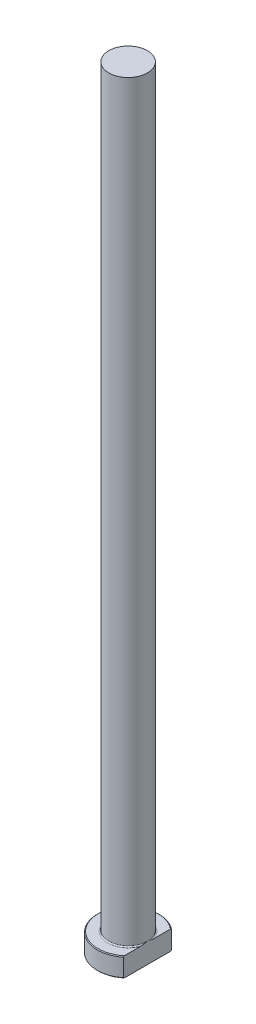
ISO-10303-21;
HEADER;
FILE_DESCRIPTION(('STEP AP214'),'2;1');
FILE_NAME('part.step','',(''),(''),'','','');
FILE_SCHEMA(('AUTOMOTIVE_DESIGN { 1 0 10303 214 1 1 1 1 }'));
ENDSEC;
DATA;
#1=APPLICATION_CONTEXT('core data for automotive mechanical design processes');
#2=APPLICATION_PROTOCOL_DEFINITION('international standard','automotive_design',2000,#1);
#3=PRODUCT_CONTEXT('',#1,'mechanical');
#4=PRODUCT('Part','Part','',(#3));
#5=PRODUCT_RELATED_PRODUCT_CATEGORY('part','',(#4));
#6=PRODUCT_DEFINITION_FORMATION('','',#4);
#7=PRODUCT_DEFINITION_CONTEXT('part definition',#1,'design');
#8=PRODUCT_DEFINITION('design','',#6,#7);
#9=PRODUCT_DEFINITION_SHAPE('','',#8);
#10=(LENGTH_UNIT() NAMED_UNIT(*) SI_UNIT(.MILLI.,.METRE.));
#11=(NAMED_UNIT(*) PLANE_ANGLE_UNIT() SI_UNIT($,.RADIAN.));
#12=(NAMED_UNIT(*) SI_UNIT($,.STERADIAN.) SOLID_ANGLE_UNIT());
#13=UNCERTAINTY_MEASURE_WITH_UNIT(LENGTH_MEASURE(1.E-05),#10,'distance_accuracy_value','');
#14=(GEOMETRIC_REPRESENTATION_CONTEXT(3) GLOBAL_UNCERTAINTY_ASSIGNED_CONTEXT((#13)) GLOBAL_UNIT_ASSIGNED_CONTEXT((#10,
#11,#12)) REPRESENTATION_CONTEXT('',''));
#15=CARTESIAN_POINT('',(0.,0.,0.));
#16=DIRECTION('',(0.,0.,1.));
#17=DIRECTION('',(1.,0.,0.));
#18=AXIS2_PLACEMENT_3D('',#15,#16,#17);
#19=CARTESIAN_POINT('',(0.,0.,0.));
#20=DIRECTION('',(0.,-1.,0.));
#21=DIRECTION('',(0.,0.,-1.));
#22=AXIS2_PLACEMENT_3D('',#19,#20,#21);
#23=PLANE('',#22);
#24=CARTESIAN_POINT('',(0.,0.,0.));
#25=DIRECTION('',(0.,-1.,0.));
#26=DIRECTION('',(0.,0.,-1.));
#27=AXIS2_PLACEMENT_3D('',#24,#25,#26);
#28=CIRCLE('',#27,7.79999999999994);
#29=CARTESIAN_POINT('',(4.99999999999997,0.,5.98665181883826));
#30=VERTEX_POINT('',#29);
#31=CARTESIAN_POINT('',(4.99999999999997,0.,-5.98665181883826));
#32=VERTEX_POINT('',#31);
#33=EDGE_CURVE('E98',#30,#32,#28,.T.);
#34=ORIENTED_EDGE('',*,*,#33,.T.);
#35=DIRECTION('',(0.,0.,1.));
#36=VECTOR('',#35,1.);
#37=CARTESIAN_POINT('',(4.99999999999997,0.,-6.24499799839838));
#38=LINE('',#37,#36);
#39=EDGE_CURVE('E83',#32,#30,#38,.T.);
#40=ORIENTED_EDGE('',*,*,#39,.T.);
#41=EDGE_LOOP('',(#34,#40));
#42=FACE_BOUND('',#41,.T.);
#43=ADVANCED_FACE('F32',(#42),#23,.T.);
#44=CARTESIAN_POINT('',(0.,259.958771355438,0.));
#45=DIRECTION('',(0.,1.,0.));
#46=DIRECTION('',(0.,0.,1.));
#47=AXIS2_PLACEMENT_3D('',#44,#45,#46);
#48=CYLINDRICAL_SURFACE('',#47,7.99999999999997);
#49=CARTESIAN_POINT('',(0.,4.80000000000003,0.));
#50=DIRECTION('',(0.,1.,0.));
#51=DIRECTION('',(0.,0.,1.));
#52=AXIS2_PLACEMENT_3D('',#49,#50,#51);
#53=CIRCLE('',#52,7.99999999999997);
#54=CARTESIAN_POINT('',(4.99999999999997,4.80000000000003,6.24499799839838));
#55=VERTEX_POINT('',#54);
#56=CARTESIAN_POINT('',(4.99999999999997,4.80000000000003,-6.24499799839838));
#57=VERTEX_POINT('',#56);
#58=EDGE_CURVE('E104',#55,#57,#53,.F.);
#59=ORIENTED_EDGE('',*,*,#58,.T.);
#60=DIRECTION('',(0.,-1.,0.));
#61=VECTOR('',#60,1.);
#62=CARTESIAN_POINT('',(4.99999999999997,200.,-6.24499799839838));
#63=LINE('',#62,#61);
#64=CARTESIAN_POINT('',(4.99999999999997,0.200000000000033,-6.24499799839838));
#65=VERTEX_POINT('',#64);
#66=EDGE_CURVE('E183',#57,#65,#63,.T.);
#67=ORIENTED_EDGE('',*,*,#66,.T.);
#68=CARTESIAN_POINT('',(0.,0.200000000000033,0.));
#69=DIRECTION('',(0.,-1.,0.));
#70=DIRECTION('',(0.,0.,-1.));
#71=AXIS2_PLACEMENT_3D('',#68,#69,#70);
#72=CIRCLE('',#71,7.99999999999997);
#73=CARTESIAN_POINT('',(4.99999999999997,0.200000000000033,6.24499799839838));
#74=VERTEX_POINT('',#73);
#75=EDGE_CURVE('E100',#65,#74,#72,.F.);
#76=ORIENTED_EDGE('',*,*,#75,.T.);
#77=DIRECTION('',(0.,-1.,0.));
#78=VECTOR('',#77,1.);
#79=CARTESIAN_POINT('',(4.99999999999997,200.,6.24499799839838));
#80=LINE('',#79,#78);
#81=EDGE_CURVE('E93',#55,#74,#80,.T.);
#82=ORIENTED_EDGE('',*,*,#81,.F.);
#83=EDGE_LOOP('',(#59,#67,#76,#82));
#84=FACE_BOUND('',#83,.T.);
#85=ADVANCED_FACE('F158',(#84),#48,.T.);
#86=CARTESIAN_POINT('',(-7.99999999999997,5.,0.));
#87=DIRECTION('',(0.,1.,0.));
#88=DIRECTION('',(0.,0.,1.));
#89=AXIS2_PLACEMENT_3D('',#86,#87,#88);
#90=PLANE('',#89);
#91=CARTESIAN_POINT('',(0.,5.,0.));
#92=DIRECTION('',(0.,1.,0.));
#93=DIRECTION('',(0.,0.,1.));
#94=AXIS2_PLACEMENT_3D('',#91,#92,#93);
#95=CIRCLE('',#94,7.79999999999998);
#96=CARTESIAN_POINT('',(4.99999999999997,5.,-5.9866518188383));
#97=VERTEX_POINT('',#96);
#98=CARTESIAN_POINT('',(4.99999999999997,5.,5.9866518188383));
#99=VERTEX_POINT('',#98);
#100=EDGE_CURVE('E178',#97,#99,#95,.T.);
#101=ORIENTED_EDGE('',*,*,#100,.T.);
#102=DIRECTION('',(0.,0.,-1.));
#103=VECTOR('',#102,1.);
#104=CARTESIAN_POINT('',(4.99999999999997,5.,0.));
#105=LINE('',#104,#103);
#106=CARTESIAN_POINT('',(4.99999999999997,4.99999999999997,1.75783958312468));
#107=VERTEX_POINT('',#106);
#108=EDGE_CURVE('E57',#99,#107,#105,.T.);
#109=ORIENTED_EDGE('',*,*,#108,.T.);
#110=CARTESIAN_POINT('',(0.,5.,0.));
#111=DIRECTION('',(0.,1.,0.));
#112=DIRECTION('',(0.,0.,1.));
#113=AXIS2_PLACEMENT_3D('',#110,#111,#112);
#114=CIRCLE('',#113,5.29999999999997);
#115=CARTESIAN_POINT('',(4.99999999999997,4.99999999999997,-1.75783958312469));
#116=VERTEX_POINT('',#115);
#117=EDGE_CURVE('E107',#107,#116,#114,.F.);
#118=ORIENTED_EDGE('',*,*,#117,.T.);
#119=EDGE_CURVE('E136',#116,#97,#105,.T.);
#120=ORIENTED_EDGE('',*,*,#119,.T.);
#121=EDGE_LOOP('',(#101,#109,#118,#120));
#122=FACE_BOUND('',#121,.T.);
#123=ADVANCED_FACE('F147',(#122),#90,.T.);
#124=CARTESIAN_POINT('',(0.,5.,0.));
#125=DIRECTION('',(0.,-1.,0.));
#126=DIRECTION('',(0.,0.,-1.));
#127=AXIS2_PLACEMENT_3D('',#124,#125,#126);
#128=CONICAL_SURFACE('',#127,7.79999999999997,0.785398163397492);
#129=ORIENTED_EDGE('',*,*,#58,.F.);
#130=CARTESIAN_POINT('',(4.99999999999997,-1.82162423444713,13.7401563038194));
#131=CARTESIAN_POINT('',(4.99999999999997,-1.61889813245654,13.5244204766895));
#132=CARTESIAN_POINT('',(4.99999999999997,-1.41646387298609,13.3084101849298));
#133=CARTESIAN_POINT('',(4.99999999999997,-1.01227657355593,12.8757508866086));
#134=CARTESIAN_POINT('',(4.99999999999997,-0.810523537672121,12.65910187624));
#135=CARTESIAN_POINT('',(4.99999999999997,-0.206157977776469,12.0077661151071));
#136=CARTESIAN_POINT('',(4.99999999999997,0.195280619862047,11.571988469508));
#137=CARTESIAN_POINT('',(4.99999999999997,1.00388282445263,10.6856136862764));
#138=CARTESIAN_POINT('',(4.99999999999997,1.41093902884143,10.234918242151));
#139=CARTESIAN_POINT('',(4.99999999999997,2.01658324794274,9.55471676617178));
#140=CARTESIAN_POINT('',(4.99999999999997,2.2175823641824,9.32735800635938));
#141=CARTESIAN_POINT('',(4.99999999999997,2.61761142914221,8.87091599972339));
#142=CARTESIAN_POINT('',(4.99999999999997,2.81664139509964,8.64183276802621));
#143=CARTESIAN_POINT('',(4.99999999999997,3.21217345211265,8.18170099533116));
#144=CARTESIAN_POINT('',(4.99999999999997,3.4086768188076,7.95065355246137));
#145=CARTESIAN_POINT('',(4.99999999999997,3.79865427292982,7.48599989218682));
#146=CARTESIAN_POINT('',(4.99999999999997,3.99212827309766,7.25239360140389));
#147=CARTESIAN_POINT('',(4.99999999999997,4.37558160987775,6.78155890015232));
#148=CARTESIAN_POINT('',(4.99999999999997,4.5655533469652,6.54432428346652));
#149=CARTESIAN_POINT('',(4.99999999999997,4.94042138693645,6.065895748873));
#150=CARTESIAN_POINT('',(4.99999999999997,5.12531810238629,5.82470215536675));
#151=CARTESIAN_POINT('',(4.99999999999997,5.48653546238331,5.33972956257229));
#152=CARTESIAN_POINT('',(4.99999999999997,5.6629239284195,5.09600137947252));
#153=CARTESIAN_POINT('',(4.99999999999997,6.00675382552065,4.60213647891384));
#154=CARTESIAN_POINT('',(4.99999999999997,6.17419169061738,4.35199726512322));
#155=CARTESIAN_POINT('',(4.99999999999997,6.49592993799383,3.84445040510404));
#156=CARTESIAN_POINT('',(4.99999999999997,6.65027272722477,3.5870701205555));
#157=CARTESIAN_POINT('',(4.99999999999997,6.86813414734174,3.19356592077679));
#158=CARTESIAN_POINT('',(4.99999999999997,6.93845533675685,3.06120993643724));
#159=CARTESIAN_POINT('',(4.99999999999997,7.07360441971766,2.7937331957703));
#160=CARTESIAN_POINT('',(4.99999999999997,7.13843319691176,2.65861288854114));
#161=CARTESIAN_POINT('',(4.99999999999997,7.26869642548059,2.36936389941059));
#162=CARTESIAN_POINT('',(4.99999999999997,7.33331212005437,2.21486278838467));
#163=CARTESIAN_POINT('',(4.99999999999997,7.45243473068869,1.90194073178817));
#164=CARTESIAN_POINT('',(4.99999999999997,7.50694001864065,1.74351915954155));
#165=CARTESIAN_POINT('',(4.99999999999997,7.60343746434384,1.42384276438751));
#166=CARTESIAN_POINT('',(4.99999999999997,7.64549910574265,1.26260921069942));
#167=CARTESIAN_POINT('',(4.99999999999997,7.71543089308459,0.937062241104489));
#168=CARTESIAN_POINT('',(4.99999999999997,7.74330266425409,0.772749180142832));
#169=CARTESIAN_POINT('',(4.99999999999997,7.78344284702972,0.439876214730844));
#170=CARTESIAN_POINT('',(4.99999999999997,7.79548961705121,0.271289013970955));
#171=CARTESIAN_POINT('',(4.99999999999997,7.80240809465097,-0.066227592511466));
#172=CARTESIAN_POINT('',(4.99999999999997,7.79728142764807,-0.235156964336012));
#173=CARTESIAN_POINT('',(4.99999999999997,7.77017954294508,-0.572209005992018));
#174=CARTESIAN_POINT('',(4.99999999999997,7.74814735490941,-0.740327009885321));
#175=CARTESIAN_POINT('',(4.99999999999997,7.68863212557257,-1.07379849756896));
#176=CARTESIAN_POINT('',(4.99999999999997,7.65114437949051,-1.23915112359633));
#177=CARTESIAN_POINT('',(4.99999999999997,7.54734433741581,-1.62344926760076));
#178=CARTESIAN_POINT('',(4.99999999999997,7.47553580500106,-1.84089917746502));
#179=CARTESIAN_POINT('',(4.99999999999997,7.31300119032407,-2.26856946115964));
#180=CARTESIAN_POINT('',(4.99999999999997,7.22226460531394,-2.47878574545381));
#181=CARTESIAN_POINT('',(4.99999999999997,7.07492970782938,-2.79014067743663));
#182=CARTESIAN_POINT('',(4.99999999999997,7.0236227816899,-2.89384077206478));
#183=CARTESIAN_POINT('',(4.99999999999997,6.91783840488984,-3.09961626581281));
#184=CARTESIAN_POINT('',(4.99999999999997,6.86336091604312,-3.20169164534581));
#185=CARTESIAN_POINT('',(4.99999999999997,6.75169048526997,-3.40428995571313));
#186=CARTESIAN_POINT('',(4.99999999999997,6.69449856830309,-3.50481345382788));
#187=CARTESIAN_POINT('',(4.99999999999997,6.57774196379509,-3.70446206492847));
#188=CARTESIAN_POINT('',(4.99999999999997,6.51817739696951,-3.80358724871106));
#189=CARTESIAN_POINT('',(4.99999999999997,6.30853654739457,-4.1443576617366));
#190=CARTESIAN_POINT('',(4.99999999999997,6.15326588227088,-4.3828135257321));
#191=CARTESIAN_POINT('',(4.99999999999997,5.8337719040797,-4.85367607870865));
#192=CARTESIAN_POINT('',(4.99999999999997,5.66954595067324,-5.08608095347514));
#193=CARTESIAN_POINT('',(4.99999999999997,5.33431698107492,-5.5462855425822));
#194=CARTESIAN_POINT('',(4.99999999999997,5.16330740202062,-5.77408045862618));
#195=CARTESIAN_POINT('',(4.99999999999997,4.81629923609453,-6.22578157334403));
#196=CARTESIAN_POINT('',(4.99999999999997,4.64030119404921,-6.44968819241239));
#197=CARTESIAN_POINT('',(4.99999999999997,4.28368615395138,-6.89532578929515));
#198=CARTESIAN_POINT('',(4.99999999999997,4.10305289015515,-7.11704371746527));
#199=CARTESIAN_POINT('',(4.99999999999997,3.73870710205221,-7.55793799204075));
#200=CARTESIAN_POINT('',(4.99999999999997,3.55499450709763,-7.77711427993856));
#201=CARTESIAN_POINT('',(4.99999999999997,3.18521083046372,-8.21325328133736));
#202=CARTESIAN_POINT('',(4.99999999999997,2.99914113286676,-8.43021717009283));
#203=CARTESIAN_POINT('',(4.99999999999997,2.62499812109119,-8.86241167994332));
#204=CARTESIAN_POINT('',(4.99999999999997,2.43692478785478,-9.07764228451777));
#205=CARTESIAN_POINT('',(4.99999999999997,1.91463404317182,-9.67075518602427));
#206=CARTESIAN_POINT('',(4.99999999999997,1.57868086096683,-10.0471086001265));
#207=CARTESIAN_POINT('',(4.99999999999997,0.903003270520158,-10.7965122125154));
#208=CARTESIAN_POINT('',(4.99999999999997,0.563278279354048,-11.1695618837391));
#209=CARTESIAN_POINT('',(4.99999999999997,-0.116149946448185,-11.9100168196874));
#210=CARTESIAN_POINT('',(4.99999999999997,-0.455830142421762,-12.2774432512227));
#211=CARTESIAN_POINT('',(4.99999999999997,-1.13728640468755,-13.0102135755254));
#212=CARTESIAN_POINT('',(4.99999999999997,-1.47906204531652,-13.3755578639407));
#213=CARTESIAN_POINT('',(4.99999999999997,-1.82162423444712,-13.7401563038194));
#214=B_SPLINE_CURVE_WITH_KNOTS('',3,(#130,#131,#132,#133,#134,#135,#136,#137,#138,#139,#140,
#141,#142,#143,#144,#145,#146,#147,#148,#149,#150,#151,#152,#153,#154,#155,#156,#157,#158,#159,
#160,#161,#162,#163,#164,#165,#166,#167,#168,#169,#170,#171,#172,#173,#174,#175,#176,#177,#178,
#179,#180,#181,#182,#183,#184,#185,#186,#187,#188,#189,#190,#191,#192,#193,#194,#195,#196,#197,
#198,#199,#200,#201,#202,#203,#204,#205,#206,#207,#208,#209,#210,#211,#212,#213),.UNSPECIFIED.,
.F.,.F.,(4,2,2,2,2,2,2,2,2,2,2,2,2,2,2,2,2,2,2,2,2,2,2,2,2,2,2,2,2,2,2,2,2,2,2,2,2,2,2,2,2,4),
(0.,0.888120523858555,1.77624635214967,3.55372511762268,5.37559481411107,6.28598924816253,
7.19637570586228,8.10628289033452,9.01621623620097,9.92793449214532,10.8395784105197,
11.7420025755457,12.6447836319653,13.5445196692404,13.9940505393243,14.4435089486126,
14.9456212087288,15.4478142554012,15.947147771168,16.4464240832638,16.952621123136,
17.4587702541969,17.966632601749,18.4746496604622,19.1604516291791,19.8466351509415,
20.1936870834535,20.5407431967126,20.8876692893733,21.2345777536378,22.0879097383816,
22.9414946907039,23.79592661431,24.6502655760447,25.5081848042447,26.3661237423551,
27.2235803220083,28.0810450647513,29.5944656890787,31.1081235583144,32.6092678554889,
34.1101167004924),.UNSPECIFIED.);
#215=EDGE_CURVE('E135',#55,#99,#214,.T.);
#216=ORIENTED_EDGE('',*,*,#215,.T.);
#217=ORIENTED_EDGE('',*,*,#100,.F.);
#218=EDGE_CURVE('E127',#97,#57,#214,.T.);
#219=ORIENTED_EDGE('',*,*,#218,.T.);
#220=EDGE_LOOP('',(#129,#216,#217,#219));
#221=FACE_BOUND('',#220,.T.);
#222=ADVANCED_FACE('F143',(#221),#128,.T.);
#223=CARTESIAN_POINT('',(0.,0.200000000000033,0.));
#224=DIRECTION('',(0.,1.,0.));
#225=DIRECTION('',(0.,0.,1.));
#226=AXIS2_PLACEMENT_3D('',#223,#224,#225);
#227=CONICAL_SURFACE('',#226,7.99999999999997,0.785398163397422);
#228=ORIENTED_EDGE('',*,*,#75,.F.);
#229=CARTESIAN_POINT('',(4.99999999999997,6.8216242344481,-13.7401563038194));
#230=CARTESIAN_POINT('',(4.99999999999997,6.6188981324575,-13.5244204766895));
#231=CARTESIAN_POINT('',(4.99999999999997,6.41646387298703,-13.3084101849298));
#232=CARTESIAN_POINT('',(4.99999999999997,6.01227657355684,-12.8757508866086));
#233=CARTESIAN_POINT('',(4.99999999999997,5.81052353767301,-12.6591018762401));
#234=CARTESIAN_POINT('',(4.99999999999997,5.2061579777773,-12.0077661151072));
#235=CARTESIAN_POINT('',(4.99999999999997,4.80471938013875,-11.5719884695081));
#236=CARTESIAN_POINT('',(4.99999999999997,3.9961171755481,-10.6856136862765));
#237=CARTESIAN_POINT('',(4.99999999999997,3.58906097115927,-10.2349182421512));
#238=CARTESIAN_POINT('',(4.99999999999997,2.9834167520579,-9.55471676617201));
#239=CARTESIAN_POINT('',(4.99999999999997,2.78241763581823,-9.32735800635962));
#240=CARTESIAN_POINT('',(4.99999999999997,2.38238857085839,-8.87091599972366));
#241=CARTESIAN_POINT('',(4.99999999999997,2.18335860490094,-8.64183276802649));
#242=CARTESIAN_POINT('',(4.99999999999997,1.78782654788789,-8.18170099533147));
#243=CARTESIAN_POINT('',(4.99999999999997,1.59132318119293,-7.9506535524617));
#244=CARTESIAN_POINT('',(4.99999999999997,1.20134572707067,-7.48599989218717));
#245=CARTESIAN_POINT('',(4.99999999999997,1.00787172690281,-7.25239360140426));
#246=CARTESIAN_POINT('',(4.99999999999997,0.62441839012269,-6.78155890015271));
#247=CARTESIAN_POINT('',(4.99999999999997,0.434446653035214,-6.54432428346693));
#248=CARTESIAN_POINT('',(4.99999999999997,0.0595786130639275,-6.06589574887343));
#249=CARTESIAN_POINT('',(4.99999999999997,-0.125318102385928,-5.8247021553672));
#250=CARTESIAN_POINT('',(4.99999999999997,-0.486535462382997,-5.33972956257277));
#251=CARTESIAN_POINT('',(4.99999999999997,-0.662923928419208,-5.09600137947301));
#252=CARTESIAN_POINT('',(4.99999999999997,-1.0067538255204,-4.60213647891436));
#253=CARTESIAN_POINT('',(4.99999999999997,-1.17419169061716,-4.35199726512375));
#254=CARTESIAN_POINT('',(4.99999999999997,-1.49592993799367,-3.8444504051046));
#255=CARTESIAN_POINT('',(4.99999999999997,-1.65027272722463,-3.58707012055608));
#256=CARTESIAN_POINT('',(4.99999999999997,-1.86813414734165,-3.19356592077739));
#257=CARTESIAN_POINT('',(4.99999999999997,-1.93845533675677,-3.06120993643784));
#258=CARTESIAN_POINT('',(4.99999999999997,-2.07360441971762,-2.79373319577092));
#259=CARTESIAN_POINT('',(4.99999999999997,-2.13843319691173,-2.65861288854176));
#260=CARTESIAN_POINT('',(4.99999999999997,-2.2686964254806,-2.36936389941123));
#261=CARTESIAN_POINT('',(4.99999999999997,-2.3333121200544,-2.21486278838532));
#262=CARTESIAN_POINT('',(4.99999999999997,-2.45243473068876,-1.90194073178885));
#263=CARTESIAN_POINT('',(4.99999999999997,-2.50694001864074,-1.74351915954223));
#264=CARTESIAN_POINT('',(4.99999999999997,-2.60343746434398,-1.42384276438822));
#265=CARTESIAN_POINT('',(4.99999999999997,-2.6454991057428,-1.26260921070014));
#266=CARTESIAN_POINT('',(4.99999999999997,-2.71543089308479,-0.937062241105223));
#267=CARTESIAN_POINT('',(4.99999999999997,-2.74330266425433,-0.772749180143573));
#268=CARTESIAN_POINT('',(4.99999999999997,-2.78344284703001,-0.439876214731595));
#269=CARTESIAN_POINT('',(4.99999999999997,-2.79548961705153,-0.271289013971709));
#270=CARTESIAN_POINT('',(4.99999999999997,-2.80240809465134,0.0662275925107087));
#271=CARTESIAN_POINT('',(4.99999999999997,-2.79728142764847,0.235156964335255));
#272=CARTESIAN_POINT('',(4.99999999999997,-2.77017954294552,0.572209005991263));
#273=CARTESIAN_POINT('',(4.99999999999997,-2.74814735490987,0.740327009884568));
#274=CARTESIAN_POINT('',(4.99999999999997,-2.68863212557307,1.07379849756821));
#275=CARTESIAN_POINT('',(4.99999999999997,-2.65114437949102,1.23915112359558));
#276=CARTESIAN_POINT('',(4.99999999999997,-2.54734433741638,1.62344926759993));
#277=CARTESIAN_POINT('',(4.99999999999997,-2.47553580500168,1.84089917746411));
#278=CARTESIAN_POINT('',(4.99999999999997,-2.31300119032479,2.26856946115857));
#279=CARTESIAN_POINT('',(4.99999999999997,-2.22226460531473,2.47878574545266));
#280=CARTESIAN_POINT('',(4.99999999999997,-2.07492970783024,2.79014067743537));
#281=CARTESIAN_POINT('',(4.99999999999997,-2.02362278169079,2.89384077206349));
#282=CARTESIAN_POINT('',(4.99999999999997,-1.9178384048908,3.09961626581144));
#283=CARTESIAN_POINT('',(4.99999999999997,-1.8633609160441,3.20169164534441));
#284=CARTESIAN_POINT('',(4.99999999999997,-1.75169048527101,3.40428995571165));
#285=CARTESIAN_POINT('',(4.99999999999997,-1.69449856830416,3.50481345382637));
#286=CARTESIAN_POINT('',(4.99999999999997,-1.57774196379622,3.70446206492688));
#287=CARTESIAN_POINT('',(4.99999999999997,-1.51817739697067,3.80358724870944));
#288=CARTESIAN_POINT('',(4.99999999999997,-1.30853654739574,4.14435766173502));
#289=CARTESIAN_POINT('',(4.99999999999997,-1.15326588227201,4.38281352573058));
#290=CARTESIAN_POINT('',(4.99999999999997,-0.83377190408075,4.85367607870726));
#291=CARTESIAN_POINT('',(4.99999999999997,-0.669545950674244,5.08608095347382));
#292=CARTESIAN_POINT('',(4.99999999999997,-0.334316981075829,5.54628554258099));
#293=CARTESIAN_POINT('',(4.99999999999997,-0.163307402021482,5.77408045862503));
#294=CARTESIAN_POINT('',(4.99999999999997,0.183700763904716,6.22578157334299));
#295=CARTESIAN_POINT('',(4.99999999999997,0.359698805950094,6.44968819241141));
#296=CARTESIAN_POINT('',(4.99999999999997,0.71631384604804,6.89532578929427));
#297=CARTESIAN_POINT('',(4.99999999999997,0.896947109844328,7.11704371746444));
#298=CARTESIAN_POINT('',(4.99999999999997,1.2612928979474,7.55793799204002));
#299=CARTESIAN_POINT('',(4.99999999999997,1.44500549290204,7.77711427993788));
#300=CARTESIAN_POINT('',(4.99999999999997,1.81478916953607,8.21325328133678));
#301=CARTESIAN_POINT('',(4.99999999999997,2.00085886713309,8.4302171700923));
#302=CARTESIAN_POINT('',(4.99999999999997,2.37500187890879,8.86241167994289));
#303=CARTESIAN_POINT('',(4.99999999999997,2.56307521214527,9.07764228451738));
#304=CARTESIAN_POINT('',(4.99999999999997,3.08536595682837,9.67075518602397));
#305=CARTESIAN_POINT('',(4.99999999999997,3.42131913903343,10.0471086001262));
#306=CARTESIAN_POINT('',(4.99999999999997,4.09699672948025,10.7965122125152));
#307=CARTESIAN_POINT('',(4.99999999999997,4.43672172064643,11.169561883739));
#308=CARTESIAN_POINT('',(4.99999999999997,5.11614994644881,11.9100168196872));
#309=CARTESIAN_POINT('',(4.99999999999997,5.45583014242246,12.2774432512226));
#310=CARTESIAN_POINT('',(4.99999999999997,6.13728640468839,13.0102135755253));
#311=CARTESIAN_POINT('',(4.99999999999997,6.47906204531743,13.3755578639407));
#312=CARTESIAN_POINT('',(4.99999999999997,6.8216242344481,13.7401563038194));
#313=B_SPLINE_CURVE_WITH_KNOTS('',3,(#229,#230,#231,#232,#233,#234,#235,#236,#237,#238,#239,
#240,#241,#242,#243,#244,#245,#246,#247,#248,#249,#250,#251,#252,#253,#254,#255,#256,#257,#258,
#259,#260,#261,#262,#263,#264,#265,#266,#267,#268,#269,#270,#271,#272,#273,#274,#275,#276,#277,
#278,#279,#280,#281,#282,#283,#284,#285,#286,#287,#288,#289,#290,#291,#292,#293,#294,#295,#296,
#297,#298,#299,#300,#301,#302,#303,#304,#305,#306,#307,#308,#309,#310,#311,#312),.UNSPECIFIED.,
.F.,.F.,(4,2,2,2,2,2,2,2,2,2,2,2,2,2,2,2,2,2,2,2,2,2,2,2,2,2,2,2,2,2,2,2,2,2,2,2,2,2,2,2,2,4),
(0.,0.888120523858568,1.77624635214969,3.55372511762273,5.37559481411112,6.28598924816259,
7.19637570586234,8.10628289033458,9.01621623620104,9.92793449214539,10.8395784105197,
11.7420025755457,12.6447836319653,13.5445196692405,13.9940505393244,14.4435089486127,
14.9456212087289,15.4478142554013,15.9471477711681,16.4464240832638,16.952621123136,
17.458770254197,17.9666326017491,18.4746496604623,19.1604516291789,19.846635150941,
20.1936870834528,20.5407431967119,20.8876692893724,21.2345777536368,22.0879097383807,
22.9414946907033,23.7959266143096,24.6502655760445,25.5081848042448,26.3661237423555,
27.2235803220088,28.0810450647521,29.5944656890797,31.1081235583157,32.6092678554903,
34.110116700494),.UNSPECIFIED.);
#314=EDGE_CURVE('E86',#65,#32,#313,.T.);
#315=ORIENTED_EDGE('',*,*,#314,.T.);
#316=ORIENTED_EDGE('',*,*,#33,.F.);
#317=EDGE_CURVE('E89',#30,#74,#313,.T.);
#318=ORIENTED_EDGE('',*,*,#317,.T.);
#319=EDGE_LOOP('',(#228,#315,#316,#318));
#320=FACE_BOUND('',#319,.T.);
#321=ADVANCED_FACE('F97',(#320),#227,.T.);
#322=CARTESIAN_POINT('',(0.,5.29999999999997,0.));
#323=DIRECTION('',(0.,1.,0.));
#324=DIRECTION('',(0.,0.,1.));
#325=AXIS2_PLACEMENT_3D('',#322,#323,#324);
#326=TOROIDAL_SURFACE('',#325,5.29999999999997,0.3);
#327=CARTESIAN_POINT('',(4.99999999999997,5.29999999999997,0.));
#328=CARTESIAN_POINT('',(4.99999999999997,5.30000062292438,1.31469639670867E-10));
#329=CARTESIAN_POINT('',(4.99999999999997,5.30000124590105,-2.52759209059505E-07));
#330=CARTESIAN_POINT('',(4.99999999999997,5.30000240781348,-9.47164325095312E-07));
#331=CARTESIAN_POINT('',(4.99999999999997,5.30000293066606,-1.40594036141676E-06));
#332=CARTESIAN_POINT('',(4.99999999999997,5.30000402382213,-2.50637603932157E-06));
#333=CARTESIAN_POINT('',(4.99999999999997,5.30000457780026,-3.16588904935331E-06));
#334=CARTESIAN_POINT('',(4.99999999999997,5.30000556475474,-4.52859961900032E-06));
#335=CARTESIAN_POINT('',(4.99999999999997,5.30000600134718,-5.22939444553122E-06));
#336=CARTESIAN_POINT('',(4.99999999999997,5.30000763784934,-7.9612197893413E-06));
#337=CARTESIAN_POINT('',(4.99999999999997,5.30000875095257,-1.0047740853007E-05));
#338=CARTESIAN_POINT('',(4.99999999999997,5.3000105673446,-1.4166087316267E-05));
#339=CARTESIAN_POINT('',(4.99999999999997,5.30001129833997,-1.6186178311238E-05));
#340=CARTESIAN_POINT('',(4.99999999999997,5.30001439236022,-2.47865739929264E-05));
#341=CARTESIAN_POINT('',(4.99999999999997,5.30001672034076,-3.13830281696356E-05));
#342=CARTESIAN_POINT('',(4.99999999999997,5.30002012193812,-4.38084218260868E-05));
#343=CARTESIAN_POINT('',(4.99999999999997,5.30002133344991,-4.95992737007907E-05));
#344=CARTESIAN_POINT('',(4.99999999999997,5.30003020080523,-9.27862610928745E-05));
#345=CARTESIAN_POINT('',(4.99999999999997,5.30003696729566,-0.000130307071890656));
#346=CARTESIAN_POINT('',(4.99999999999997,5.30006659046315,-0.000278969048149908));
#347=CARTESIAN_POINT('',(4.99999999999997,5.30009481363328,-0.000389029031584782));
#348=CARTESIAN_POINT('',(4.99999999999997,5.30020506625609,-0.000826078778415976));
#349=CARTESIAN_POINT('',(4.99999999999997,5.30028365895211,-0.00115365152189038));
#350=CARTESIAN_POINT('',(4.99999999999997,5.3005991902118,-0.00245925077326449));
#351=CARTESIAN_POINT('',(4.99999999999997,5.30084048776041,-0.00343651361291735));
#352=CARTESIAN_POINT('',(4.99999999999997,5.30184626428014,-0.00752058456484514));
#353=CARTESIAN_POINT('',(4.99999999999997,5.30260525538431,-0.0106283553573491));
#354=CARTESIAN_POINT('',(4.99999999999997,5.30996461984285,-0.0407482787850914));
#355=CARTESIAN_POINT('',(4.99999999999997,5.31658985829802,-0.0677561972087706));
#356=CARTESIAN_POINT('',(4.99999999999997,5.32953319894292,-0.120688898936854));
#357=CARTESIAN_POINT('',(4.99999999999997,5.33585289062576,-0.146613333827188));
#358=CARTESIAN_POINT('',(4.99999999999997,5.34926050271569,-0.201795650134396));
#359=CARTESIAN_POINT('',(4.99999999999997,5.35634306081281,-0.231054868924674));
#360=CARTESIAN_POINT('',(4.99999999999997,5.37050252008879,-0.289917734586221));
#361=CARTESIAN_POINT('',(4.99999999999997,5.37757848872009,-0.319521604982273));
#362=CARTESIAN_POINT('',(4.99999999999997,5.39452602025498,-0.391032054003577));
#363=CARTESIAN_POINT('',(4.99999999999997,5.40434071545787,-0.432952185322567));
#364=CARTESIAN_POINT('',(4.99999999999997,5.42340141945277,-0.515763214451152));
#365=CARTESIAN_POINT('',(4.99999999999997,5.43265559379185,-0.556652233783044));
#366=CARTESIAN_POINT('',(4.99999999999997,5.45710553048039,-0.667075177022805));
#367=CARTESIAN_POINT('',(4.99999999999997,5.47194176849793,-0.736689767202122));
#368=CARTESIAN_POINT('',(4.99999999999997,5.50018229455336,-0.876836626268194));
#369=CARTESIAN_POINT('',(4.99999999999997,5.51357312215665,-0.947371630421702));
#370=CARTESIAN_POINT('',(4.99999999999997,5.53930921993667,-1.09497328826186));
#371=CARTESIAN_POINT('',(4.99999999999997,5.55146217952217,-1.17207432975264));
#372=CARTESIAN_POINT('',(4.99999999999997,5.57239669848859,-1.32672649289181));
#373=CARTESIAN_POINT('',(4.99999999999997,5.58117877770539,-1.40427754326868));
#374=CARTESIAN_POINT('',(4.99999999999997,5.594997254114,-1.5687382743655));
#375=CARTESIAN_POINT('',(4.99999999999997,5.59948802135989,-1.65570044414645));
#376=CARTESIAN_POINT('',(4.99999999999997,5.60018885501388,-1.78535304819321));
#377=CARTESIAN_POINT('',(4.99999999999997,5.59945214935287,-1.82802575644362));
#378=CARTESIAN_POINT('',(4.99999999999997,5.59559364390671,-1.91325081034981));
#379=CARTESIAN_POINT('',(4.99999999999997,5.59247319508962,-1.95580321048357));
#380=CARTESIAN_POINT('',(4.99999999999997,5.5838324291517,-2.03512365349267));
#381=CARTESIAN_POINT('',(4.99999999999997,5.57867386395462,-2.07192937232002));
#382=CARTESIAN_POINT('',(4.99999999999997,5.56543793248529,-2.1452675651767));
#383=CARTESIAN_POINT('',(4.99999999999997,5.55734203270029,-2.18179676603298));
#384=CARTESIAN_POINT('',(4.99999999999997,5.53718005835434,-2.25427226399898));
#385=CARTESIAN_POINT('',(4.99999999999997,5.52507057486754,-2.29020746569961));
#386=CARTESIAN_POINT('',(4.99999999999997,5.50270928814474,-2.34223029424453));
#387=CARTESIAN_POINT('',(4.99999999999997,5.4945781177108,-2.35922314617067));
#388=CARTESIAN_POINT('',(4.99999999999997,5.47657809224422,-2.39224900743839));
#389=CARTESIAN_POINT('',(4.99999999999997,5.46671281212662,-2.40828390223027));
#390=CARTESIAN_POINT('',(4.99999999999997,5.44695893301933,-2.43579467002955));
#391=CARTESIAN_POINT('',(4.99999999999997,5.43745879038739,-2.44754592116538));
#392=CARTESIAN_POINT('',(4.99999999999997,5.41677914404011,-2.46946476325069));
#393=CARTESIAN_POINT('',(4.99999999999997,5.40560543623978,-2.47963758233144));
#394=CARTESIAN_POINT('',(4.99999999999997,5.38617750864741,-2.49393642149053));
#395=CARTESIAN_POINT('',(4.99999999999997,5.37851643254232,-2.49886271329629));
#396=CARTESIAN_POINT('',(4.99999999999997,5.36252740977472,-2.50749953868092));
#397=CARTESIAN_POINT('',(4.99999999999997,5.35419984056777,-2.51121075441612));
#398=CARTESIAN_POINT('',(4.99999999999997,5.33690648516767,-2.51712941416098));
#399=CARTESIAN_POINT('',(4.99999999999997,5.32793451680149,-2.51931927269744));
#400=CARTESIAN_POINT('',(4.99999999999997,5.30973576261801,-2.52185978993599));
#401=CARTESIAN_POINT('',(4.99999999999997,5.30050931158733,-2.52221275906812));
#402=CARTESIAN_POINT('',(4.99999999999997,5.28349166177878,-2.52112455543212));
#403=CARTESIAN_POINT('',(4.99999999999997,5.27568322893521,-2.519931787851));
#404=CARTESIAN_POINT('',(4.99999999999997,5.26036860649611,-2.51628294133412));
#405=CARTESIAN_POINT('',(4.99999999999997,5.25286261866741,-2.51382603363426));
#406=CARTESIAN_POINT('',(4.99999999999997,5.23590266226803,-2.50685484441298));
#407=CARTESIAN_POINT('',(4.99999999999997,5.22661875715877,-2.50192984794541));
#408=CARTESIAN_POINT('',(4.99999999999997,5.20895514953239,-2.49066548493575));
#409=CARTESIAN_POINT('',(4.99999999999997,5.2005775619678,-2.48432291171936));
#410=CARTESIAN_POINT('',(4.99999999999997,5.17987008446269,-2.46645212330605));
#411=CARTESIAN_POINT('',(4.99999999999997,5.1682415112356,-2.45411867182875));
#412=CARTESIAN_POINT('',(4.99999999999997,5.14692461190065,-2.42790849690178));
#413=CARTESIAN_POINT('',(4.99999999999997,5.13723987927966,-2.41402898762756));
#414=CARTESIAN_POINT('',(4.99999999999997,5.11080706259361,-2.37143175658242));
#415=CARTESIAN_POINT('',(4.99999999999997,5.09628770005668,-2.3413470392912));
#416=CARTESIAN_POINT('',(4.99999999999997,5.07130349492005,-2.27940731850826));
#417=CARTESIAN_POINT('',(4.99999999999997,5.06087110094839,-2.24754035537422));
#418=CARTESIAN_POINT('',(4.99999999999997,5.03890359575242,-2.16787245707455));
#419=CARTESIAN_POINT('',(4.99999999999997,5.02913523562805,-2.11959065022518));
#420=CARTESIAN_POINT('',(4.99999999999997,5.01416953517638,-2.0222492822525));
#421=CARTESIAN_POINT('',(4.99999999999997,5.00898637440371,-1.97318778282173));
#422=CARTESIAN_POINT('',(4.99999999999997,5.00220823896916,-1.87635767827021));
#423=CARTESIAN_POINT('',(4.99999999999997,5.00050709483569,-1.82859609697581));
#424=CARTESIAN_POINT('',(4.99999999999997,4.99969104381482,-1.73330165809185));
#425=CARTESIAN_POINT('',(4.99999999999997,5.00056327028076,-1.68576884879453));
#426=CARTESIAN_POINT('',(4.99999999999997,5.0048429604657,-1.57937770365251));
#427=CARTESIAN_POINT('',(4.99999999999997,5.00880932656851,-1.52054285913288));
#428=CARTESIAN_POINT('',(4.99999999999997,5.01925964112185,-1.40312974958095));
#429=CARTESIAN_POINT('',(4.99999999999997,5.02574264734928,-1.3445513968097));
#430=CARTESIAN_POINT('',(4.99999999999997,5.04090087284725,-1.2262766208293));
#431=CARTESIAN_POINT('',(4.99999999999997,5.04962425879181,-1.16658647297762));
#432=CARTESIAN_POINT('',(4.99999999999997,5.06877923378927,-1.04732463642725));
#433=CARTESIAN_POINT('',(4.99999999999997,5.07921523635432,-0.987753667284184));
#434=CARTESIAN_POINT('',(4.99999999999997,5.10551698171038,-0.846936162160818));
#435=CARTESIAN_POINT('',(4.99999999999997,5.1219656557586,-0.765799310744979));
#436=CARTESIAN_POINT('',(4.99999999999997,5.15639716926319,-0.604819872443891));
#437=CARTESIAN_POINT('',(4.99999999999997,5.17436050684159,-0.52497303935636));
#438=CARTESIAN_POINT('',(4.99999999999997,5.20921667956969,-0.374726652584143));
#439=CARTESIAN_POINT('',(4.99999999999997,5.22599388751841,-0.304300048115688));
#440=CARTESIAN_POINT('',(4.99999999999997,5.25191105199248,-0.196907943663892));
#441=CARTESIAN_POINT('',(4.99999999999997,5.26090146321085,-0.159905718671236));
#442=CARTESIAN_POINT('',(4.99999999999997,5.27881854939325,-0.0865164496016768));
#443=CARTESIAN_POINT('',(4.99999999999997,5.28774391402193,-0.0501291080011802));
#444=CARTESIAN_POINT('',(4.99999999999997,5.29739627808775,-0.0106218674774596));
#445=CARTESIAN_POINT('',(4.99999999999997,5.29815688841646,-0.00750762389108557));
#446=CARTESIAN_POINT('',(4.99999999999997,5.29916304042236,-0.00342209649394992));
#447=CARTESIAN_POINT('',(4.99999999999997,5.29940309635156,-0.0024498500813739));
#448=CARTESIAN_POINT('',(4.99999999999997,5.29971711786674,-0.0011504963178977));
#449=CARTESIAN_POINT('',(4.99999999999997,5.29979541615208,-0.00082414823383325));
#450=CARTESIAN_POINT('',(4.99999999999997,5.29990531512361,-0.000388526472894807));
#451=CARTESIAN_POINT('',(4.99999999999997,5.29993348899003,-0.000278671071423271));
#452=CARTESIAN_POINT('',(4.99999999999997,5.29996306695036,-0.000130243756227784));
#453=CARTESIAN_POINT('',(4.99999999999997,5.29996982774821,-9.27511375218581E-05));
#454=CARTESIAN_POINT('',(4.99999999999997,5.29997868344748,-4.95929886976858E-05));
#455=CARTESIAN_POINT('',(4.99999999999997,5.29997989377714,-4.38036552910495E-05));
#456=CARTESIAN_POINT('',(4.99999999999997,5.29998329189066,-3.13814183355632E-05));
#457=CARTESIAN_POINT('',(4.99999999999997,5.2999856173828,-2.47865218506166E-05));
#458=CARTESIAN_POINT('',(4.99999999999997,5.2999887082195,-1.61877546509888E-05));
#459=CARTESIAN_POINT('',(4.99999999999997,5.29998943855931,-1.41677768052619E-05));
#460=CARTESIAN_POINT('',(4.99999999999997,5.29999125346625,-1.00495529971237E-05));
#461=CARTESIAN_POINT('',(4.99999999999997,5.29999236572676,-7.96302653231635E-06));
#462=CARTESIAN_POINT('',(4.99999999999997,5.29999400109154,-5.23107414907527E-06));
#463=CARTESIAN_POINT('',(4.99999999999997,5.29999443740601,-4.5302103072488E-06));
#464=CARTESIAN_POINT('',(4.99999999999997,5.29999542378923,-3.16731152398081E-06));
#465=CARTESIAN_POINT('',(4.99999999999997,5.29999597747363,-2.50767724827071E-06));
#466=CARTESIAN_POINT('',(4.99999999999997,5.2999970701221,-1.40695877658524E-06));
#467=CARTESIAN_POINT('',(4.99999999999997,5.29999759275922,-9.48032429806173E-07));
#468=CARTESIAN_POINT('',(4.99999999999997,5.29999875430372,-2.53244317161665E-07));
#469=CARTESIAN_POINT('',(4.99999999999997,5.29999937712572,-1.31459052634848E-10));
#470=CARTESIAN_POINT('',(4.99999999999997,5.29999999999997,0.));
#471=B_SPLINE_CURVE_WITH_KNOTS('',3,(#327,#328,#329,#330,#331,#332,#333,#334,#335,#336,#337,
#338,#339,#340,#341,#342,#343,#344,#345,#346,#347,#348,#349,#350,#351,#352,#353,#354,#355,#356,
#357,#358,#359,#360,#361,#362,#363,#364,#365,#366,#367,#368,#369,#370,#371,#372,#373,#374,#375,
#376,#377,#378,#379,#380,#381,#382,#383,#384,#385,#386,#387,#388,#389,#390,#391,#392,#393,#394,
#395,#396,#397,#398,#399,#400,#401,#402,#403,#404,#405,#406,#407,#408,#409,#410,#411,#412,#413,
#414,#415,#416,#417,#418,#419,#420,#421,#422,#423,#424,#425,#426,#427,#428,#429,#430,#431,#432,
#433,#434,#435,#436,#437,#438,#439,#440,#441,#442,#443,#444,#445,#446,#447,#448,#449,#450,#451,
#452,#453,#454,#455,#456,#457,#458,#459,#460,#461,#462,#463,#464,#465,#466,#467,#468,#469,#470),
.UNSPECIFIED.,.T.,.F.,(4,2,2,2,2,2,2,2,2,2,2,2,2,2,2,2,2,2,2,2,2,2,2,2,2,2,2,2,2,2,2,2,2,2,2,2,
2,2,2,2,2,2,2,2,2,2,2,2,2,2,2,2,2,2,2,2,2,2,2,2,2,2,2,2,2,2,2,2,2,2,2,4),(0.,
1.88939317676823E-06,3.98058917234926E-06,6.54818564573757E-06,9.0240439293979E-06,
1.60938750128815E-05,2.25328198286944E-05,4.34843921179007E-05,6.12120199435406E-05,
0.000175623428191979,0.000516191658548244,0.00152710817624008,0.00454656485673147,
0.0141443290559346,0.0975679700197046,0.1776193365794,0.267931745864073,0.359245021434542,
0.488405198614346,0.614173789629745,0.827694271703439,1.04305715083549,1.27715608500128,
1.51121890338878,1.77214751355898,1.90013509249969,2.02805018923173,2.13945459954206,
2.25157451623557,2.36494894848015,2.4213923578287,2.47772074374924,2.52293802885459,
2.5680021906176,2.59524342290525,2.62246933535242,2.65000494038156,2.67750590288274,
2.70108948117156,2.72468854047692,2.75603978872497,2.78746268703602,2.83802806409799,
2.88868607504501,2.98834295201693,3.08877575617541,3.23618650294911,3.38405153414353,
3.52733651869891,3.66990630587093,3.84673903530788,4.02350562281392,4.204447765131,
4.38586374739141,4.63419556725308,4.87971270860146,5.09690175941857,5.2111388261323,
5.32353360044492,5.33315137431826,5.33615533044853,5.33716246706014,5.33750240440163,
5.33761672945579,5.33763445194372,5.33765539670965,5.33766183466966,5.33766890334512,
5.33767137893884,5.3376739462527,5.33767603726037,5.3376779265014),.UNSPECIFIED.);
#472=CARTESIAN_POINT('',(4.99999999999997,5.29999999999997,0.));
#473=VERTEX_POINT('',#472);
#474=EDGE_CURVE('E11',#116,#473,#471,.T.);
#475=ORIENTED_EDGE('',*,*,#474,.F.);
#476=ORIENTED_EDGE('',*,*,#117,.F.);
#477=CARTESIAN_POINT('',(4.99999999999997,5.29999999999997,0.));
#478=CARTESIAN_POINT('',(4.99999999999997,5.29999937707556,-1.31469681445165E-10));
#479=CARTESIAN_POINT('',(4.99999999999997,5.29999875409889,2.52759208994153E-07));
#480=CARTESIAN_POINT('',(4.99999999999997,5.29999759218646,9.47164324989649E-07));
#481=CARTESIAN_POINT('',(4.99999999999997,5.29999706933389,1.40594036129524E-06));
#482=CARTESIAN_POINT('',(4.99999999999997,5.29999597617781,2.50637603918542E-06));
#483=CARTESIAN_POINT('',(4.99999999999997,5.29999542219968,3.16588904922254E-06));
#484=CARTESIAN_POINT('',(4.99999999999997,5.29999443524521,4.52859961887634E-06));
#485=CARTESIAN_POINT('',(4.99999999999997,5.29999399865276,5.22939444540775E-06));
#486=CARTESIAN_POINT('',(4.99999999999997,5.2999923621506,7.96121978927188E-06));
#487=CARTESIAN_POINT('',(4.99999999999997,5.29999124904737,1.00477408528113E-05));
#488=CARTESIAN_POINT('',(4.99999999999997,5.29998943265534,1.41660873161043E-05));
#489=CARTESIAN_POINT('',(4.99999999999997,5.29998870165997,1.61861783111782E-05));
#490=CARTESIAN_POINT('',(4.99999999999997,5.29998560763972,2.47865739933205E-05));
#491=CARTESIAN_POINT('',(4.99999999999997,5.29998327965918,3.13830281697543E-05));
#492=CARTESIAN_POINT('',(4.99999999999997,5.29997987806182,4.38084218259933E-05));
#493=CARTESIAN_POINT('',(4.99999999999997,5.29997866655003,4.95992737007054E-05));
#494=CARTESIAN_POINT('',(4.99999999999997,5.29996979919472,9.27862610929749E-05));
#495=CARTESIAN_POINT('',(4.99999999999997,5.29996303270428,0.000130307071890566));
#496=CARTESIAN_POINT('',(4.99999999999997,5.29993340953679,0.000278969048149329));
#497=CARTESIAN_POINT('',(4.99999999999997,5.29990518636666,0.000389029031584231));
#498=CARTESIAN_POINT('',(4.99999999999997,5.29979493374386,0.000826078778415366));
#499=CARTESIAN_POINT('',(4.99999999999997,5.29971634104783,0.00115365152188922));
#500=CARTESIAN_POINT('',(4.99999999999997,5.29940080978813,0.00245925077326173));
#501=CARTESIAN_POINT('',(4.99999999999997,5.29915951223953,0.00343651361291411));
#502=CARTESIAN_POINT('',(4.99999999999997,5.29815373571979,0.00752058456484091));
#503=CARTESIAN_POINT('',(4.99999999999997,5.29739474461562,0.0106283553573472));
#504=CARTESIAN_POINT('',(4.99999999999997,5.29003538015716,0.040748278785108));
#505=CARTESIAN_POINT('',(4.99999999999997,5.28341014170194,0.0677561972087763));
#506=CARTESIAN_POINT('',(4.99999999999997,5.270466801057,0.120688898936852));
#507=CARTESIAN_POINT('',(4.99999999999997,5.26414710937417,0.146613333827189));
#508=CARTESIAN_POINT('',(4.99999999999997,5.25073949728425,0.201795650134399));
#509=CARTESIAN_POINT('',(4.99999999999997,5.24365693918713,0.231054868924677));
#510=CARTESIAN_POINT('',(4.99999999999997,5.22949747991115,0.289917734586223));
#511=CARTESIAN_POINT('',(4.99999999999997,5.22242151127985,0.319521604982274));
#512=CARTESIAN_POINT('',(4.99999999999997,5.20547397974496,0.391032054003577));
#513=CARTESIAN_POINT('',(4.99999999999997,5.19565928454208,0.432952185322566));
#514=CARTESIAN_POINT('',(4.99999999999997,5.17659858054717,0.515763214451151));
#515=CARTESIAN_POINT('',(4.99999999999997,5.16734440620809,0.556652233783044));
#516=CARTESIAN_POINT('',(4.99999999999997,5.14289446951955,0.667075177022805));
#517=CARTESIAN_POINT('',(4.99999999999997,5.12805823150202,0.736689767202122));
#518=CARTESIAN_POINT('',(4.99999999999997,5.09981770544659,0.876836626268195));
#519=CARTESIAN_POINT('',(4.99999999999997,5.08642687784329,0.947371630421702));
#520=CARTESIAN_POINT('',(4.99999999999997,5.06069078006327,1.09497328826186));
#521=CARTESIAN_POINT('',(4.99999999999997,5.04853782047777,1.17207432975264));
#522=CARTESIAN_POINT('',(4.99999999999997,5.02760330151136,1.32672649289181));
#523=CARTESIAN_POINT('',(4.99999999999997,5.01882122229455,1.40427754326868));
#524=CARTESIAN_POINT('',(4.99999999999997,5.00500274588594,1.5687382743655));
#525=CARTESIAN_POINT('',(4.99999999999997,5.00051197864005,1.65570044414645));
#526=CARTESIAN_POINT('',(4.99999999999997,4.99981114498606,1.78535304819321));
#527=CARTESIAN_POINT('',(4.99999999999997,5.00054785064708,1.82802575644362));
#528=CARTESIAN_POINT('',(4.99999999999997,5.00440635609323,1.91325081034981));
#529=CARTESIAN_POINT('',(4.99999999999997,5.00752680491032,1.95580321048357));
#530=CARTESIAN_POINT('',(4.99999999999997,5.01616757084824,2.03512365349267));
#531=CARTESIAN_POINT('',(4.99999999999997,5.02132613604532,2.07192937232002));
#532=CARTESIAN_POINT('',(4.99999999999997,5.03456206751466,2.1452675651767));
#533=CARTESIAN_POINT('',(4.99999999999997,5.04265796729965,2.18179676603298));
#534=CARTESIAN_POINT('',(4.99999999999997,5.0628199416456,2.25427226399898));
#535=CARTESIAN_POINT('',(4.99999999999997,5.07492942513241,2.29020746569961));
#536=CARTESIAN_POINT('',(4.99999999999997,5.09729071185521,2.34223029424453));
#537=CARTESIAN_POINT('',(4.99999999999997,5.10542188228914,2.35922314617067));
#538=CARTESIAN_POINT('',(4.99999999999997,5.12342190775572,2.39224900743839));
#539=CARTESIAN_POINT('',(4.99999999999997,5.13328718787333,2.40828390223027));
#540=CARTESIAN_POINT('',(4.99999999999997,5.15304106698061,2.43579467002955));
#541=CARTESIAN_POINT('',(4.99999999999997,5.16254120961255,2.44754592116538));
#542=CARTESIAN_POINT('',(4.99999999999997,5.18322085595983,2.46946476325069));
#543=CARTESIAN_POINT('',(4.99999999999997,5.19439456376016,2.47963758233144));
#544=CARTESIAN_POINT('',(4.99999999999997,5.21382249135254,2.49393642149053));
#545=CARTESIAN_POINT('',(4.99999999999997,5.22148356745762,2.49886271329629));
#546=CARTESIAN_POINT('',(4.99999999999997,5.23747259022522,2.50749953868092));
#547=CARTESIAN_POINT('',(4.99999999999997,5.24580015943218,2.51121075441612));
#548=CARTESIAN_POINT('',(4.99999999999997,5.26309351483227,2.51712941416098));
#549=CARTESIAN_POINT('',(4.99999999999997,5.27206548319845,2.51931927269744));
#550=CARTESIAN_POINT('',(4.99999999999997,5.29026423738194,2.52185978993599));
#551=CARTESIAN_POINT('',(4.99999999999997,5.29949068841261,2.52221275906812));
#552=CARTESIAN_POINT('',(4.99999999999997,5.31650833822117,2.52112455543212));
#553=CARTESIAN_POINT('',(4.99999999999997,5.32431677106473,2.519931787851));
#554=CARTESIAN_POINT('',(4.99999999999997,5.33963139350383,2.51628294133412));
#555=CARTESIAN_POINT('',(4.99999999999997,5.34713738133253,2.51382603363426));
#556=CARTESIAN_POINT('',(4.99999999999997,5.36409733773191,2.50685484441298));
#557=CARTESIAN_POINT('',(4.99999999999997,5.37338124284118,2.50192984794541));
#558=CARTESIAN_POINT('',(4.99999999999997,5.39104485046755,2.49066548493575));
#559=CARTESIAN_POINT('',(4.99999999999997,5.39942243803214,2.48432291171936));
#560=CARTESIAN_POINT('',(4.99999999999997,5.42012991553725,2.46645212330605));
#561=CARTESIAN_POINT('',(4.99999999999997,5.43175848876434,2.45411867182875));
#562=CARTESIAN_POINT('',(4.99999999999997,5.4530753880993,2.42790849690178));
#563=CARTESIAN_POINT('',(4.99999999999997,5.46276012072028,2.41402898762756));
#564=CARTESIAN_POINT('',(4.99999999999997,5.48919293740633,2.37143175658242));
#565=CARTESIAN_POINT('',(4.99999999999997,5.50371229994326,2.3413470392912));
#566=CARTESIAN_POINT('',(4.99999999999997,5.52869650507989,2.27940731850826));
#567=CARTESIAN_POINT('',(4.99999999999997,5.53912889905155,2.24754035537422));
#568=CARTESIAN_POINT('',(4.99999999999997,5.56109640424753,2.16787245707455));
#569=CARTESIAN_POINT('',(4.99999999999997,5.57086476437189,2.11959065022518));
#570=CARTESIAN_POINT('',(4.99999999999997,5.58583046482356,2.0222492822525));
#571=CARTESIAN_POINT('',(4.99999999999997,5.59101362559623,1.97318778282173));
#572=CARTESIAN_POINT('',(4.99999999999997,5.59779176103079,1.87635767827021));
#573=CARTESIAN_POINT('',(4.99999999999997,5.59949290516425,1.82859609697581));
#574=CARTESIAN_POINT('',(4.99999999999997,5.60030895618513,1.73330165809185));
#575=CARTESIAN_POINT('',(4.99999999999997,5.59943672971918,1.68576884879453));
#576=CARTESIAN_POINT('',(4.99999999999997,5.59515703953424,1.57937770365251));
#577=CARTESIAN_POINT('',(4.99999999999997,5.59119067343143,1.52054285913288));
#578=CARTESIAN_POINT('',(4.99999999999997,5.58074035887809,1.40312974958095));
#579=CARTESIAN_POINT('',(4.99999999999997,5.57425735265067,1.3445513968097));
#580=CARTESIAN_POINT('',(4.99999999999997,5.55909912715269,1.2262766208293));
#581=CARTESIAN_POINT('',(4.99999999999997,5.55037574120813,1.16658647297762));
#582=CARTESIAN_POINT('',(4.99999999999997,5.53122076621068,1.04732463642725));
#583=CARTESIAN_POINT('',(4.99999999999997,5.52078476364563,0.987753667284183));
#584=CARTESIAN_POINT('',(4.99999999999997,5.49448301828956,0.846936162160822));
#585=CARTESIAN_POINT('',(4.99999999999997,5.47803434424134,0.765799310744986));
#586=CARTESIAN_POINT('',(4.99999999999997,5.44360283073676,0.604819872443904));
#587=CARTESIAN_POINT('',(4.99999999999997,5.42563949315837,0.524973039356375));
#588=CARTESIAN_POINT('',(4.99999999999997,5.39078332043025,0.37472665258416));
#589=CARTESIAN_POINT('',(4.99999999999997,5.37400611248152,0.304300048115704));
#590=CARTESIAN_POINT('',(4.99999999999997,5.34808894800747,0.196907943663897));
#591=CARTESIAN_POINT('',(4.99999999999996,5.33909853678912,0.159905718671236));
#592=CARTESIAN_POINT('',(4.99999999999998,5.32118145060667,0.0865164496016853));
#593=CARTESIAN_POINT('',(4.99999999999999,5.31225608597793,0.0501291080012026));
#594=CARTESIAN_POINT('',(4.99999999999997,5.3026037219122,0.0106218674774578));
#595=CARTESIAN_POINT('',(4.99999999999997,5.3018431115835,0.00750762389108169));
#596=CARTESIAN_POINT('',(4.99999999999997,5.30083695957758,0.00342209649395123));
#597=CARTESIAN_POINT('',(4.99999999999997,5.30059690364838,0.00244985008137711));
#598=CARTESIAN_POINT('',(4.99999999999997,5.30028288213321,0.00115049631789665));
#599=CARTESIAN_POINT('',(4.99999999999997,5.30020458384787,0.000824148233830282));
#600=CARTESIAN_POINT('',(4.99999999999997,5.30009468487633,0.000388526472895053));
#601=CARTESIAN_POINT('',(4.99999999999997,5.3000665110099,0.000278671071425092));
#602=CARTESIAN_POINT('',(4.99999999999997,5.30003693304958,0.000130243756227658));
#603=CARTESIAN_POINT('',(4.99999999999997,5.30003017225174,9.27511375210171E-05));
#604=CARTESIAN_POINT('',(4.99999999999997,5.30002131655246,4.95929886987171E-05));
#605=CARTESIAN_POINT('',(4.99999999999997,5.3000201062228,4.38036552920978E-05));
#606=CARTESIAN_POINT('',(4.99999999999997,5.30001670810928,3.13814183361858E-05));
#607=CARTESIAN_POINT('',(4.99999999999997,5.30001438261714,2.47865218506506E-05));
#608=CARTESIAN_POINT('',(4.99999999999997,5.30001129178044,1.61877546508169E-05));
#609=CARTESIAN_POINT('',(4.99999999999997,5.30001056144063,1.4167776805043E-05));
#610=CARTESIAN_POINT('',(4.99999999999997,5.30000874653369,1.00495529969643E-05));
#611=CARTESIAN_POINT('',(4.99999999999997,5.30000763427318,7.96302653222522E-06));
#612=CARTESIAN_POINT('',(4.99999999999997,5.3000059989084,5.23107414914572E-06));
#613=CARTESIAN_POINT('',(4.99999999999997,5.30000556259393,4.5302103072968E-06));
#614=CARTESIAN_POINT('',(4.99999999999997,5.30000457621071,3.16731152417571E-06));
#615=CARTESIAN_POINT('',(4.99999999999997,5.30000402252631,2.5076772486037E-06));
#616=CARTESIAN_POINT('',(4.99999999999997,5.30000292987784,1.40695877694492E-06));
#617=CARTESIAN_POINT('',(4.99999999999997,5.30000240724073,9.4803243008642E-07));
#618=CARTESIAN_POINT('',(4.99999999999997,5.30000124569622,2.53244317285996E-07));
#619=CARTESIAN_POINT('',(4.99999999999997,5.30000062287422,1.31459094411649E-10));
#620=CARTESIAN_POINT('',(4.99999999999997,5.29999999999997,0.));
#621=B_SPLINE_CURVE_WITH_KNOTS('',3,(#477,#478,#479,#480,#481,#482,#483,#484,#485,#486,#487,
#488,#489,#490,#491,#492,#493,#494,#495,#496,#497,#498,#499,#500,#501,#502,#503,#504,#505,#506,
#507,#508,#509,#510,#511,#512,#513,#514,#515,#516,#517,#518,#519,#520,#521,#522,#523,#524,#525,
#526,#527,#528,#529,#530,#531,#532,#533,#534,#535,#536,#537,#538,#539,#540,#541,#542,#543,#544,
#545,#546,#547,#548,#549,#550,#551,#552,#553,#554,#555,#556,#557,#558,#559,#560,#561,#562,#563,
#564,#565,#566,#567,#568,#569,#570,#571,#572,#573,#574,#575,#576,#577,#578,#579,#580,#581,#582,
#583,#584,#585,#586,#587,#588,#589,#590,#591,#592,#593,#594,#595,#596,#597,#598,#599,#600,#601,
#602,#603,#604,#605,#606,#607,#608,#609,#610,#611,#612,#613,#614,#615,#616,#617,#618,#619,#620),
.UNSPECIFIED.,.T.,.F.,(4,2,2,2,2,2,2,2,2,2,2,2,2,2,2,2,2,2,2,2,2,2,2,2,2,2,2,2,2,2,2,2,2,2,2,2,
2,2,2,2,2,2,2,2,2,2,2,2,2,2,2,2,2,2,2,2,2,2,2,2,2,2,2,2,2,2,2,2,2,2,2,4),(0.,
1.88939317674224E-06,3.98058917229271E-06,6.54818564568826E-06,9.02404392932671E-06,
1.60938750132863E-05,2.25328198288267E-05,4.34843921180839E-05,6.12120199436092E-05,
0.000175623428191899,0.000516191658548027,0.00152710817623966,0.00454656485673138,
0.0141443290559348,0.0975679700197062,0.177619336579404,0.267931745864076,0.359245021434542,
0.488405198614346,0.614173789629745,0.82769427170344,1.04305715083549,1.27715608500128,
1.51121890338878,1.77214751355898,1.9001350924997,2.02805018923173,2.13945459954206,
2.25157451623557,2.36494894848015,2.4213923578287,2.47772074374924,2.52293802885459,
2.56800219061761,2.59524342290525,2.62246933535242,2.65000494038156,2.67750590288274,
2.70108948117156,2.72468854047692,2.75603978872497,2.78746268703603,2.83802806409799,
2.88868607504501,2.98834295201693,3.08877575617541,3.23618650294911,3.38405153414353,
3.52733651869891,3.66990630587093,3.84673903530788,4.02350562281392,4.204447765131,
4.38586374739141,4.63419556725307,4.87971270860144,5.09690175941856,5.2111388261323,
5.32353360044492,5.33315137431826,5.33615533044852,5.33716246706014,5.33750240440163,
5.33761672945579,5.33763445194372,5.33765539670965,5.33766183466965,5.33766890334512,
5.33767137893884,5.3376739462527,5.33767603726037,5.3376779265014),.UNSPECIFIED.);
#622=EDGE_CURVE('E46',#473,#107,#621,.T.);
#623=ORIENTED_EDGE('',*,*,#622,.F.);
#624=CARTESIAN_POINT('',(0.,5.29999999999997,0.));
#625=DIRECTION('',(0.,1.,0.));
#626=DIRECTION('',(0.,0.,1.));
#627=AXIS2_PLACEMENT_3D('',#624,#625,#626);
#628=CIRCLE('',#627,4.99999999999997);
#629=EDGE_CURVE('E103',#473,#473,#628,.T.);
#630=ORIENTED_EDGE('',*,*,#629,.F.);
#631=EDGE_LOOP('',(#475,#476,#623,#630));
#632=FACE_BOUND('',#631,.T.);
#633=ADVANCED_FACE('F34',(#632),#326,.F.);
#634=CARTESIAN_POINT('',(0.,259.958771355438,0.));
#635=DIRECTION('',(0.,1.,0.));
#636=DIRECTION('',(0.,0.,1.));
#637=AXIS2_PLACEMENT_3D('',#634,#635,#636);
#638=CYLINDRICAL_SURFACE('',#637,4.99999999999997);
#639=ORIENTED_EDGE('',*,*,#629,.T.);
#640=EDGE_LOOP('',(#639));
#641=FACE_BOUND('',#640,.T.);
#642=CARTESIAN_POINT('',(0.,200.,0.));
#643=DIRECTION('',(0.,1.,0.));
#644=DIRECTION('',(0.,0.,1.));
#645=AXIS2_PLACEMENT_3D('',#642,#643,#644);
#646=CIRCLE('',#645,4.99999999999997);
#647=CARTESIAN_POINT('',(0.,200.,4.99999999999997));
#648=VERTEX_POINT('',#647);
#649=EDGE_CURVE('E101',#648,#648,#646,.T.);
#650=ORIENTED_EDGE('',*,*,#649,.F.);
#651=EDGE_LOOP('',(#650));
#652=FACE_BOUND('',#651,.T.);
#653=ADVANCED_FACE('F155',(#641,#652),#638,.T.);
#654=CARTESIAN_POINT('',(-4.99999999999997,200.,0.));
#655=DIRECTION('',(0.,1.,0.));
#656=DIRECTION('',(0.,0.,1.));
#657=AXIS2_PLACEMENT_3D('',#654,#655,#656);
#658=PLANE('',#657);
#659=ORIENTED_EDGE('',*,*,#649,.T.);
#660=EDGE_LOOP('',(#659));
#661=FACE_BOUND('',#660,.T.);
#662=ADVANCED_FACE('F121',(#661),#658,.T.);
#663=CARTESIAN_POINT('',(4.99999999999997,200.,-6.24499799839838));
#664=DIRECTION('',(1.,0.,0.));
#665=DIRECTION('',(0.,0.,-1.));
#666=AXIS2_PLACEMENT_3D('',#663,#664,#665);
#667=PLANE('',#666);
#668=ORIENTED_EDGE('',*,*,#66,.F.);
#669=ORIENTED_EDGE('',*,*,#218,.F.);
#670=ORIENTED_EDGE('',*,*,#119,.F.);
#671=ORIENTED_EDGE('',*,*,#474,.T.);
#672=ORIENTED_EDGE('',*,*,#622,.T.);
#673=ORIENTED_EDGE('',*,*,#108,.F.);
#674=ORIENTED_EDGE('',*,*,#215,.F.);
#675=ORIENTED_EDGE('',*,*,#81,.T.);
#676=ORIENTED_EDGE('',*,*,#317,.F.);
#677=ORIENTED_EDGE('',*,*,#39,.F.);
#678=ORIENTED_EDGE('',*,*,#314,.F.);
#679=EDGE_LOOP('',(#668,#669,#670,#671,#672,#673,#674,#675,#676,#677,#678));
#680=FACE_BOUND('',#679,.T.);
#681=ADVANCED_FACE('F85',(#680),#667,.T.);
#682=CLOSED_SHELL('',(#43,#85,#123,#222,#321,#633,#653,#662,#681));
#683=MANIFOLD_SOLID_BREP('B2',#682);
#684=ADVANCED_BREP_SHAPE_REPRESENTATION('',(#18,#683),#14);
#685=SHAPE_DEFINITION_REPRESENTATION(#9,#684);
ENDSEC;
END-ISO-10303-21;
